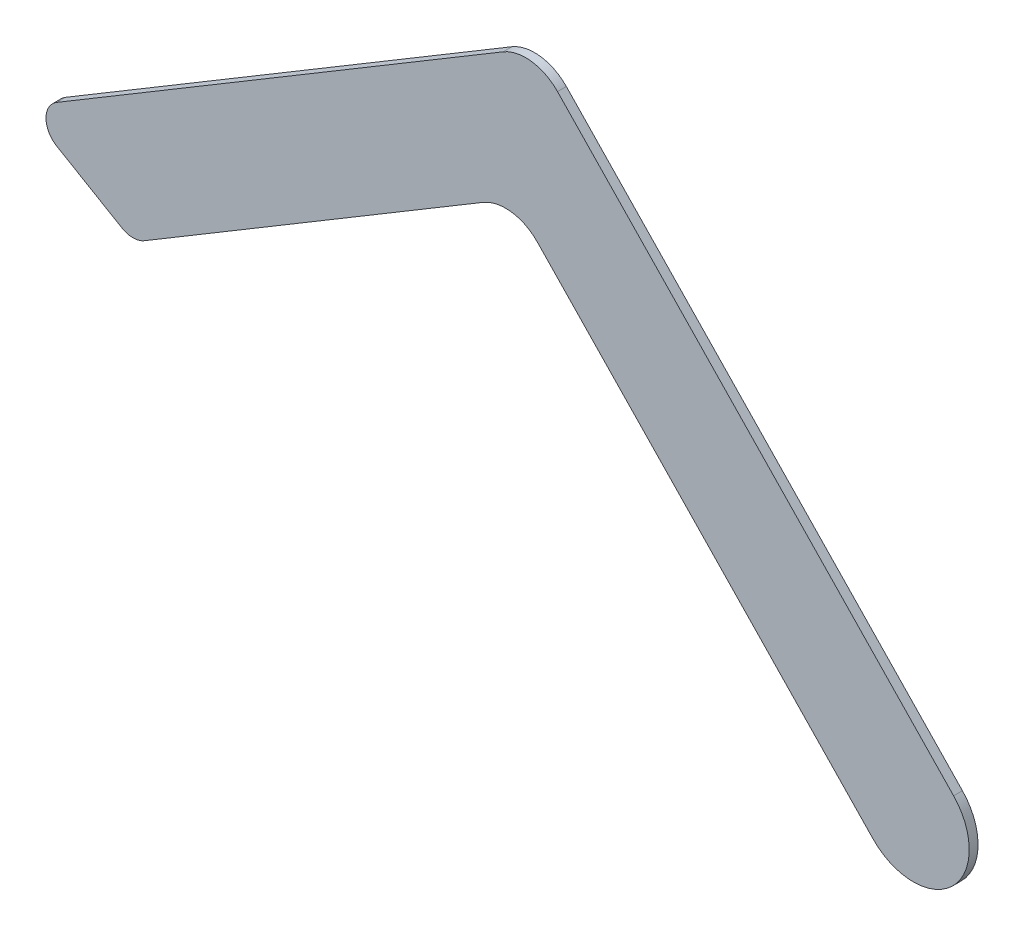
ISO-10303-21;
HEADER;
FILE_DESCRIPTION(('STEP AP214'),'2;1');
FILE_NAME('part.step','',(''),(''),'','','');
FILE_SCHEMA(('AUTOMOTIVE_DESIGN { 1 0 10303 214 1 1 1 1 }'));
ENDSEC;
DATA;
#1=APPLICATION_CONTEXT('core data for automotive mechanical design processes');
#2=APPLICATION_PROTOCOL_DEFINITION('international standard','automotive_design',2000,#1);
#3=PRODUCT_CONTEXT('',#1,'mechanical');
#4=PRODUCT('Part','Part','',(#3));
#5=PRODUCT_RELATED_PRODUCT_CATEGORY('part','',(#4));
#6=PRODUCT_DEFINITION_FORMATION('','',#4);
#7=PRODUCT_DEFINITION_CONTEXT('part definition',#1,'design');
#8=PRODUCT_DEFINITION('design','',#6,#7);
#9=PRODUCT_DEFINITION_SHAPE('','',#8);
#10=(LENGTH_UNIT() NAMED_UNIT(*) SI_UNIT(.MILLI.,.METRE.));
#11=(NAMED_UNIT(*) PLANE_ANGLE_UNIT() SI_UNIT($,.RADIAN.));
#12=(NAMED_UNIT(*) SI_UNIT($,.STERADIAN.) SOLID_ANGLE_UNIT());
#13=UNCERTAINTY_MEASURE_WITH_UNIT(LENGTH_MEASURE(1.E-05),#10,'distance_accuracy_value','');
#14=(GEOMETRIC_REPRESENTATION_CONTEXT(3) GLOBAL_UNCERTAINTY_ASSIGNED_CONTEXT((#13)) GLOBAL_UNIT_ASSIGNED_CONTEXT((#10,
#11,#12)) REPRESENTATION_CONTEXT('',''));
#15=CARTESIAN_POINT('',(0.,0.,0.));
#16=DIRECTION('',(0.,0.,1.));
#17=DIRECTION('',(1.,0.,0.));
#18=AXIS2_PLACEMENT_3D('',#15,#16,#17);
#19=CARTESIAN_POINT('',(171.245195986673,143.822185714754,4.38));
#20=DIRECTION('',(0.,0.,-1.));
#21=DIRECTION('',(-1.,0.,0.));
#22=AXIS2_PLACEMENT_3D('',#19,#20,#21);
#23=CYLINDRICAL_SURFACE('',#22,23.8);
#24=CARTESIAN_POINT('',(171.245195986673,143.822185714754,-0.38));
#25=DIRECTION('',(0.,0.,-1.));
#26=DIRECTION('',(-1.,0.,0.));
#27=AXIS2_PLACEMENT_3D('',#24,#25,#26);
#28=CIRCLE('',#27,23.8);
#29=CARTESIAN_POINT('',(159.028426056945,164.247428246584,-0.38));
#30=VERTEX_POINT('',#29);
#31=CARTESIAN_POINT('',(188.398765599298,160.320520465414,-0.38));
#32=VERTEX_POINT('',#31);
#33=EDGE_CURVE('E144',#30,#32,#28,.T.);
#34=ORIENTED_EDGE('',*,*,#33,.T.);
#35=DIRECTION('',(0.,0.,-1.));
#36=VECTOR('',#35,1.);
#37=CARTESIAN_POINT('',(188.398765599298,160.320520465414,4.38));
#38=LINE('',#37,#36);
#39=CARTESIAN_POINT('',(188.398765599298,160.320520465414,4.38));
#40=VERTEX_POINT('',#39);
#41=EDGE_CURVE('E11',#40,#32,#38,.T.);
#42=ORIENTED_EDGE('',*,*,#41,.F.);
#43=CARTESIAN_POINT('',(171.245195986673,143.822185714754,4.38));
#44=DIRECTION('',(0.,0.,-1.));
#45=DIRECTION('',(-1.,0.,0.));
#46=AXIS2_PLACEMENT_3D('',#43,#44,#45);
#47=CIRCLE('',#46,23.8);
#48=CARTESIAN_POINT('',(159.028426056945,164.247428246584,4.38));
#49=VERTEX_POINT('',#48);
#50=EDGE_CURVE('E96',#49,#40,#47,.T.);
#51=ORIENTED_EDGE('',*,*,#50,.F.);
#52=DIRECTION('',(0.,0.,-1.));
#53=VECTOR('',#52,1.);
#54=CARTESIAN_POINT('',(159.028426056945,164.247428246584,4.38));
#55=LINE('',#54,#53);
#56=EDGE_CURVE('E51',#49,#30,#55,.T.);
#57=ORIENTED_EDGE('',*,*,#56,.T.);
#58=EDGE_LOOP('',(#34,#42,#51,#57));
#59=FACE_BOUND('',#58,.T.);
#60=ADVANCED_FACE('F35',(#59),#23,.F.);
#61=CARTESIAN_POINT('',(340.087392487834,2.60754760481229,4.38));
#62=DIRECTION('',(0.720738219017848,0.693207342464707,0.));
#63=DIRECTION('',(-0.693207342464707,0.720738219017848,0.));
#64=AXIS2_PLACEMENT_3D('',#61,#62,#63);
#65=PLANE('',#64);
#66=DIRECTION('',(0.693207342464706,-0.720738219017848,0.));
#67=VECTOR('',#66,1.);
#68=CARTESIAN_POINT('',(340.087392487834,2.60754760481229,-0.38));
#69=LINE('',#68,#67);
#70=CARTESIAN_POINT('',(369.592615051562,-28.0694811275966,-0.38));
#71=VERTEX_POINT('',#70);
#72=EDGE_CURVE('E146',#32,#71,#69,.T.);
#73=ORIENTED_EDGE('',*,*,#72,.T.);
#74=DIRECTION('',(0.,0.,-1.));
#75=VECTOR('',#74,1.);
#76=CARTESIAN_POINT('',(369.592615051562,-28.0694811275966,4.38));
#77=LINE('',#76,#75);
#78=CARTESIAN_POINT('',(369.592615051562,-28.0694811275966,4.38));
#79=VERTEX_POINT('',#78);
#80=EDGE_CURVE('E43',#79,#71,#77,.T.);
#81=ORIENTED_EDGE('',*,*,#80,.F.);
#82=DIRECTION('',(-0.693207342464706,0.720738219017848,0.));
#83=VECTOR('',#82,1.);
#84=CARTESIAN_POINT('',(340.087392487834,2.60754760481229,4.38));
#85=LINE('',#84,#83);
#86=EDGE_CURVE('E203',#79,#40,#85,.T.);
#87=ORIENTED_EDGE('',*,*,#86,.T.);
#88=ORIENTED_EDGE('',*,*,#41,.T.);
#89=EDGE_LOOP('',(#73,#81,#87,#88));
#90=FACE_BOUND('',#89,.T.);
#91=ADVANCED_FACE('F224',(#90),#65,.F.);
#92=CARTESIAN_POINT('',(391.357540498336,-7.13593586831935,4.38));
#93=DIRECTION('',(0.,0.,-1.));
#94=DIRECTION('',(-1.,0.,0.));
#95=AXIS2_PLACEMENT_3D('',#92,#93,#94);
#96=CYLINDRICAL_SURFACE('',#95,30.1981008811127);
#97=CARTESIAN_POINT('',(391.357540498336,-7.13593586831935,-0.38));
#98=DIRECTION('',(0.,0.,1.));
#99=DIRECTION('',(1.,0.,0.));
#100=AXIS2_PLACEMENT_3D('',#97,#98,#99);
#101=CIRCLE('',#100,30.1981008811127);
#102=CARTESIAN_POINT('',(413.122465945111,13.7976093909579,-0.38));
#103=VERTEX_POINT('',#102);
#104=EDGE_CURVE('E148',#71,#103,#101,.T.);
#105=ORIENTED_EDGE('',*,*,#104,.T.);
#106=DIRECTION('',(0.,0.,-1.));
#107=VECTOR('',#106,1.);
#108=CARTESIAN_POINT('',(413.122465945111,13.7976093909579,4.38));
#109=LINE('',#108,#107);
#110=CARTESIAN_POINT('',(413.122465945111,13.7976093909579,4.38));
#111=VERTEX_POINT('',#110);
#112=EDGE_CURVE('E177',#111,#103,#109,.T.);
#113=ORIENTED_EDGE('',*,*,#112,.F.);
#114=CARTESIAN_POINT('',(391.357540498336,-7.13593586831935,4.38));
#115=DIRECTION('',(0.,0.,1.));
#116=DIRECTION('',(1.,0.,0.));
#117=AXIS2_PLACEMENT_3D('',#114,#115,#116);
#118=CIRCLE('',#117,30.1981008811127);
#119=EDGE_CURVE('E186',#79,#111,#118,.T.);
#120=ORIENTED_EDGE('',*,*,#119,.F.);
#121=ORIENTED_EDGE('',*,*,#80,.T.);
#122=EDGE_LOOP('',(#105,#113,#120,#121));
#123=FACE_BOUND('',#122,.T.);
#124=ADVANCED_FACE('F184',(#123),#96,.T.);
#125=CARTESIAN_POINT('',(199.258637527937,236.155085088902,4.38));
#126=DIRECTION('',(0.720738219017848,0.693207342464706,0.));
#127=DIRECTION('',(-0.693207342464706,0.720738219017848,0.));
#128=AXIS2_PLACEMENT_3D('',#125,#126,#127);
#129=PLANE('',#128);
#130=DIRECTION('',(0.693207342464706,-0.720738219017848,0.));
#131=VECTOR('',#130,1.);
#132=CARTESIAN_POINT('',(199.258637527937,236.155085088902,-0.38));
#133=LINE('',#132,#131);
#134=CARTESIAN_POINT('',(199.258637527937,236.155085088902,-0.38));
#135=VERTEX_POINT('',#134);
#136=EDGE_CURVE('E151',#135,#103,#133,.T.);
#137=ORIENTED_EDGE('',*,*,#136,.F.);
#138=DIRECTION('',(0.,0.,-1.));
#139=VECTOR('',#138,1.);
#140=CARTESIAN_POINT('',(199.258637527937,236.155085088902,4.38));
#141=LINE('',#140,#139);
#142=CARTESIAN_POINT('',(199.258637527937,236.155085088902,4.38));
#143=VERTEX_POINT('',#142);
#144=EDGE_CURVE('E175',#143,#135,#141,.T.);
#145=ORIENTED_EDGE('',*,*,#144,.F.);
#146=DIRECTION('',(0.693207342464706,-0.720738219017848,0.));
#147=VECTOR('',#146,1.);
#148=CARTESIAN_POINT('',(383.474284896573,44.6232742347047,4.38));
#149=LINE('',#148,#147);
#150=EDGE_CURVE('E197',#143,#111,#149,.T.);
#151=ORIENTED_EDGE('',*,*,#150,.T.);
#152=ORIENTED_EDGE('',*,*,#112,.T.);
#153=EDGE_LOOP('',(#137,#145,#151,#152));
#154=FACE_BOUND('',#153,.T.);
#155=ADVANCED_FACE('F196',(#154),#129,.T.);
#156=CARTESIAN_POINT('',(182.105067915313,219.656750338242,4.38));
#157=DIRECTION('',(0.,0.,-1.));
#158=DIRECTION('',(-1.,0.,0.));
#159=AXIS2_PLACEMENT_3D('',#156,#157,#158);
#160=CYLINDRICAL_SURFACE('',#159,23.8);
#161=CARTESIAN_POINT('',(182.105067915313,219.656750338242,-0.38));
#162=DIRECTION('',(0.,0.,-1.));
#163=DIRECTION('',(-1.,0.,0.));
#164=AXIS2_PLACEMENT_3D('',#161,#162,#163);
#165=CIRCLE('',#164,23.8);
#166=CARTESIAN_POINT('',(169.888297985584,240.081992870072,-0.38));
#167=VERTEX_POINT('',#166);
#168=EDGE_CURVE('E153',#167,#135,#165,.T.);
#169=ORIENTED_EDGE('',*,*,#168,.F.);
#170=DIRECTION('',(0.,0.,-1.));
#171=VECTOR('',#170,1.);
#172=CARTESIAN_POINT('',(169.888297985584,240.081992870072,4.38));
#173=LINE('',#172,#171);
#174=CARTESIAN_POINT('',(169.888297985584,240.081992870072,4.38));
#175=VERTEX_POINT('',#174);
#176=EDGE_CURVE('E173',#175,#167,#173,.T.);
#177=ORIENTED_EDGE('',*,*,#176,.F.);
#178=CARTESIAN_POINT('',(182.105067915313,219.656750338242,4.38));
#179=DIRECTION('',(0.,0.,-1.));
#180=DIRECTION('',(-1.,0.,0.));
#181=AXIS2_PLACEMENT_3D('',#178,#179,#180);
#182=CIRCLE('',#181,23.8);
#183=EDGE_CURVE('E200',#175,#143,#182,.T.);
#184=ORIENTED_EDGE('',*,*,#183,.T.);
#185=ORIENTED_EDGE('',*,*,#144,.T.);
#186=EDGE_LOOP('',(#169,#177,#184,#185));
#187=FACE_BOUND('',#186,.T.);
#188=ADVANCED_FACE('F211',(#187),#160,.T.);
#189=CARTESIAN_POINT('',(-71.1624785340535,95.9044207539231,4.38));
#190=DIRECTION('',(-0.513309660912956,0.858203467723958,0.));
#191=DIRECTION('',(-0.858203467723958,-0.513309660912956,0.));
#192=AXIS2_PLACEMENT_3D('',#189,#190,#191);
#193=PLANE('',#192);
#194=DIRECTION('',(0.858203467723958,0.513309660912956,0.));
#195=VECTOR('',#194,1.);
#196=CARTESIAN_POINT('',(-71.1624785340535,95.9044207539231,-0.38));
#197=LINE('',#196,#195);
#198=CARTESIAN_POINT('',(-71.1624785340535,95.9044207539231,-0.38));
#199=VERTEX_POINT('',#198);
#200=EDGE_CURVE('E156',#199,#167,#197,.T.);
#201=ORIENTED_EDGE('',*,*,#200,.F.);
#202=DIRECTION('',(0.,0.,-1.));
#203=VECTOR('',#202,1.);
#204=CARTESIAN_POINT('',(-71.1624785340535,95.9044207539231,4.38));
#205=LINE('',#204,#203);
#206=CARTESIAN_POINT('',(-71.1624785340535,95.9044207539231,4.38));
#207=VERTEX_POINT('',#206);
#208=EDGE_CURVE('E171',#207,#199,#205,.T.);
#209=ORIENTED_EDGE('',*,*,#208,.F.);
#210=DIRECTION('',(0.858203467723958,0.513309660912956,0.));
#211=VECTOR('',#210,1.);
#212=CARTESIAN_POINT('',(-71.1624785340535,95.9044207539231,4.38));
#213=LINE('',#212,#211);
#214=EDGE_CURVE('E139',#207,#175,#213,.T.);
#215=ORIENTED_EDGE('',*,*,#214,.T.);
#216=ORIENTED_EDGE('',*,*,#176,.T.);
#217=EDGE_LOOP('',(#201,#209,#215,#216));
#218=FACE_BOUND('',#217,.T.);
#219=ADVANCED_FACE('F209',(#218),#193,.T.);
#220=CARTESIAN_POINT('',(-65.0540935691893,85.691799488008,4.38));
#221=DIRECTION('',(0.,0.,-1.));
#222=DIRECTION('',(-1.,0.,0.));
#223=AXIS2_PLACEMENT_3D('',#220,#221,#222);
#224=CYLINDRICAL_SURFACE('',#223,11.9);
#225=CARTESIAN_POINT('',(-65.0540935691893,85.691799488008,-0.38));
#226=DIRECTION('',(0.,0.,1.));
#227=DIRECTION('',(1.,0.,0.));
#228=AXIS2_PLACEMENT_3D('',#225,#226,#227);
#229=CIRCLE('',#228,11.9);
#230=CARTESIAN_POINT('',(-71.0781296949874,75.4291980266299,-0.38));
#231=VERTEX_POINT('',#230);
#232=EDGE_CURVE('E159',#199,#231,#229,.T.);
#233=ORIENTED_EDGE('',*,*,#232,.T.);
#234=DIRECTION('',(0.,0.,-1.));
#235=VECTOR('',#234,1.);
#236=CARTESIAN_POINT('',(-71.0781296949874,75.4291980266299,4.38));
#237=LINE('',#236,#235);
#238=CARTESIAN_POINT('',(-71.0781296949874,75.4291980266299,4.38));
#239=VERTEX_POINT('',#238);
#240=EDGE_CURVE('E127',#239,#231,#237,.T.);
#241=ORIENTED_EDGE('',*,*,#240,.F.);
#242=CARTESIAN_POINT('',(-65.0540935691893,85.691799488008,4.38));
#243=DIRECTION('',(0.,0.,1.));
#244=DIRECTION('',(1.,0.,0.));
#245=AXIS2_PLACEMENT_3D('',#242,#243,#244);
#246=CIRCLE('',#245,11.9);
#247=EDGE_CURVE('E136',#207,#239,#246,.T.);
#248=ORIENTED_EDGE('',*,*,#247,.F.);
#249=ORIENTED_EDGE('',*,*,#208,.T.);
#250=EDGE_LOOP('',(#233,#241,#248,#249));
#251=FACE_BOUND('',#250,.T.);
#252=ADVANCED_FACE('F214',(#251),#224,.T.);
#253=CARTESIAN_POINT('',(-35.9702650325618,54.8212609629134,4.38));
#254=DIRECTION('',(-0.506221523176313,-0.862403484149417,0.));
#255=DIRECTION('',(0.862403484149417,-0.506221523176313,0.));
#256=AXIS2_PLACEMENT_3D('',#253,#254,#255);
#257=PLANE('',#256);
#258=DIRECTION('',(-0.862403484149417,0.506221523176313,0.));
#259=VECTOR('',#258,1.);
#260=CARTESIAN_POINT('',(-35.9702650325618,54.8212609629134,-0.38));
#261=LINE('',#260,#259);
#262=CARTESIAN_POINT('',(-35.9702650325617,54.8212609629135,-0.38));
#263=VERTEX_POINT('',#262);
#264=EDGE_CURVE('E124',#263,#231,#261,.T.);
#265=ORIENTED_EDGE('',*,*,#264,.F.);
#266=DIRECTION('',(0.,0.,-1.));
#267=VECTOR('',#266,1.);
#268=CARTESIAN_POINT('',(-35.9702650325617,54.8212609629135,4.38));
#269=LINE('',#268,#267);
#270=CARTESIAN_POINT('',(-35.9702650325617,54.8212609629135,4.38));
#271=VERTEX_POINT('',#270);
#272=EDGE_CURVE('E118',#271,#263,#269,.T.);
#273=ORIENTED_EDGE('',*,*,#272,.F.);
#274=DIRECTION('',(-0.862403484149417,0.506221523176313,0.));
#275=VECTOR('',#274,1.);
#276=CARTESIAN_POINT('',(-35.9702650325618,54.8212609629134,4.38));
#277=LINE('',#276,#275);
#278=EDGE_CURVE('E122',#271,#239,#277,.T.);
#279=ORIENTED_EDGE('',*,*,#278,.T.);
#280=ORIENTED_EDGE('',*,*,#240,.T.);
#281=EDGE_LOOP('',(#265,#273,#279,#280));
#282=FACE_BOUND('',#281,.T.);
#283=ADVANCED_FACE('F120',(#282),#257,.T.);
#284=CARTESIAN_POINT('',(-29.9462289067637,65.0838624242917,4.38));
#285=DIRECTION('',(0.,0.,-1.));
#286=DIRECTION('',(-1.,0.,0.));
#287=AXIS2_PLACEMENT_3D('',#284,#285,#286);
#288=CYLINDRICAL_SURFACE('',#287,11.9000000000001);
#289=CARTESIAN_POINT('',(-29.9462289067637,65.0838624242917,-0.38));
#290=DIRECTION('',(0.,0.,1.));
#291=DIRECTION('',(1.,0.,0.));
#292=AXIS2_PLACEMENT_3D('',#289,#290,#291);
#293=CIRCLE('',#292,11.9000000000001);
#294=CARTESIAN_POINT('',(-23.8378439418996,54.8712411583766,-0.38));
#295=VERTEX_POINT('',#294);
#296=EDGE_CURVE('E163',#263,#295,#293,.T.);
#297=ORIENTED_EDGE('',*,*,#296,.T.);
#298=DIRECTION('',(0.,0.,-1.));
#299=VECTOR('',#298,1.);
#300=CARTESIAN_POINT('',(-23.8378439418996,54.8712411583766,4.38));
#301=LINE('',#300,#299);
#302=CARTESIAN_POINT('',(-23.8378439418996,54.8712411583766,4.38));
#303=VERTEX_POINT('',#302);
#304=EDGE_CURVE('E84',#303,#295,#301,.T.);
#305=ORIENTED_EDGE('',*,*,#304,.F.);
#306=CARTESIAN_POINT('',(-29.9462289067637,65.0838624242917,4.38));
#307=DIRECTION('',(0.,0.,1.));
#308=DIRECTION('',(1.,0.,0.));
#309=AXIS2_PLACEMENT_3D('',#306,#307,#308);
#310=CIRCLE('',#309,11.9000000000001);
#311=EDGE_CURVE('E129',#271,#303,#310,.T.);
#312=ORIENTED_EDGE('',*,*,#311,.F.);
#313=ORIENTED_EDGE('',*,*,#272,.T.);
#314=EDGE_LOOP('',(#297,#305,#312,#313));
#315=FACE_BOUND('',#314,.T.);
#316=ADVANCED_FACE('F130',(#315),#288,.T.);
#317=CARTESIAN_POINT('',(159.028426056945,164.247428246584,4.38));
#318=DIRECTION('',(0.513309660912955,-0.858203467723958,0.));
#319=DIRECTION('',(0.858203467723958,0.513309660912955,0.));
#320=AXIS2_PLACEMENT_3D('',#317,#318,#319);
#321=PLANE('',#320);
#322=DIRECTION('',(-0.858203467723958,-0.513309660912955,0.));
#323=VECTOR('',#322,1.);
#324=CARTESIAN_POINT('',(159.028426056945,164.247428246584,-0.38));
#325=LINE('',#324,#323);
#326=EDGE_CURVE('E165',#30,#295,#325,.T.);
#327=ORIENTED_EDGE('',*,*,#326,.F.);
#328=ORIENTED_EDGE('',*,*,#56,.F.);
#329=DIRECTION('',(-0.858203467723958,-0.513309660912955,0.));
#330=VECTOR('',#329,1.);
#331=CARTESIAN_POINT('',(159.028426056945,164.247428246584,4.38));
#332=LINE('',#331,#330);
#333=EDGE_CURVE('E131',#49,#303,#332,.T.);
#334=ORIENTED_EDGE('',*,*,#333,.T.);
#335=ORIENTED_EDGE('',*,*,#304,.T.);
#336=EDGE_LOOP('',(#327,#328,#334,#335));
#337=FACE_BOUND('',#336,.T.);
#338=ADVANCED_FACE('F228',(#337),#321,.T.);
#339=CARTESIAN_POINT('',(171.245195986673,143.822185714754,4.38));
#340=DIRECTION('',(0.,0.,-1.));
#341=DIRECTION('',(-1.,0.,0.));
#342=AXIS2_PLACEMENT_3D('',#339,#340,#341);
#343=PLANE('',#342);
#344=ORIENTED_EDGE('',*,*,#50,.T.);
#345=ORIENTED_EDGE('',*,*,#86,.F.);
#346=ORIENTED_EDGE('',*,*,#119,.T.);
#347=ORIENTED_EDGE('',*,*,#150,.F.);
#348=ORIENTED_EDGE('',*,*,#183,.F.);
#349=ORIENTED_EDGE('',*,*,#214,.F.);
#350=ORIENTED_EDGE('',*,*,#247,.T.);
#351=ORIENTED_EDGE('',*,*,#278,.F.);
#352=ORIENTED_EDGE('',*,*,#311,.T.);
#353=ORIENTED_EDGE('',*,*,#333,.F.);
#354=EDGE_LOOP('',(#344,#345,#346,#347,#348,#349,#350,#351,#352,#353));
#355=FACE_BOUND('',#354,.T.);
#356=ADVANCED_FACE('F133',(#355),#343,.F.);
#357=CARTESIAN_POINT('',(171.245195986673,143.822185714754,-0.38));
#358=DIRECTION('',(0.,0.,-1.));
#359=DIRECTION('',(-1.,0.,0.));
#360=AXIS2_PLACEMENT_3D('',#357,#358,#359);
#361=PLANE('',#360);
#362=ORIENTED_EDGE('',*,*,#33,.F.);
#363=ORIENTED_EDGE('',*,*,#326,.T.);
#364=ORIENTED_EDGE('',*,*,#296,.F.);
#365=ORIENTED_EDGE('',*,*,#264,.T.);
#366=ORIENTED_EDGE('',*,*,#232,.F.);
#367=ORIENTED_EDGE('',*,*,#200,.T.);
#368=ORIENTED_EDGE('',*,*,#168,.T.);
#369=ORIENTED_EDGE('',*,*,#136,.T.);
#370=ORIENTED_EDGE('',*,*,#104,.F.);
#371=ORIENTED_EDGE('',*,*,#72,.F.);
#372=EDGE_LOOP('',(#362,#363,#364,#365,#366,#367,#368,#369,#370,#371));
#373=FACE_BOUND('',#372,.T.);
#374=ADVANCED_FACE('F190',(#373),#361,.T.);
#375=CLOSED_SHELL('',(#60,#91,#124,#155,#188,#219,#252,#283,#316,#338,#356,#374));
#376=MANIFOLD_SOLID_BREP('B2',#375);
#377=ADVANCED_BREP_SHAPE_REPRESENTATION('',(#18,#376),#14);
#378=SHAPE_DEFINITION_REPRESENTATION(#9,#377);
ENDSEC;
END-ISO-10303-21;
